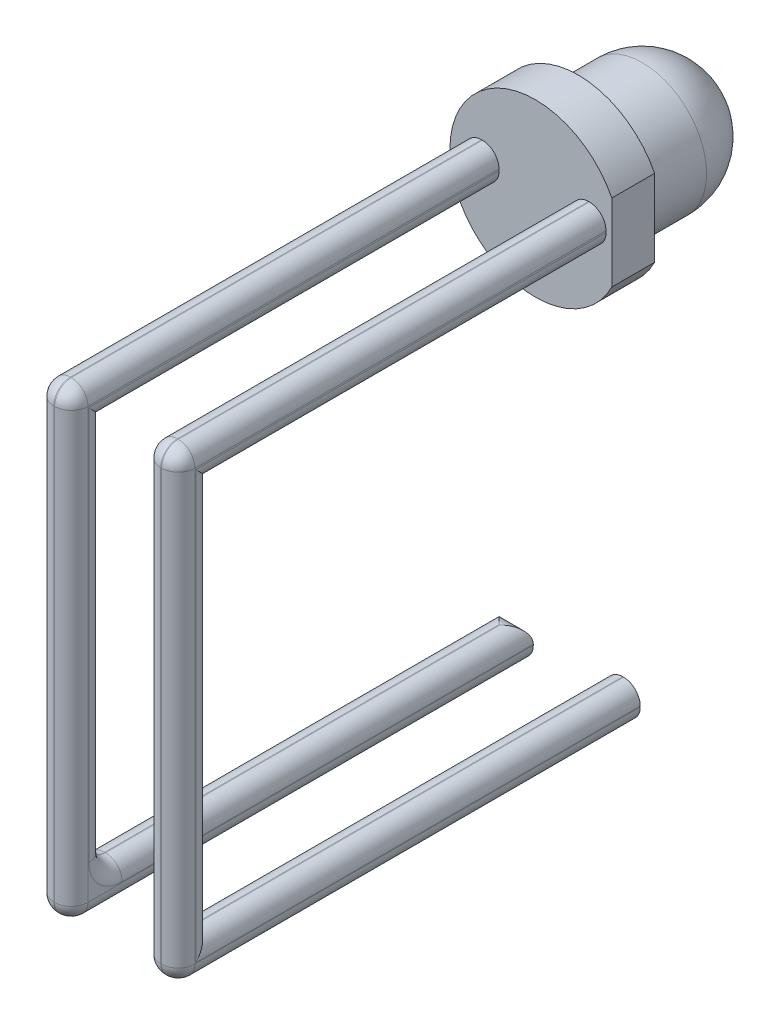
from build123d import *

# Parameters (mm, degrees)
ESQUISSE1_R             = 1.5
BASE_EXTRUSION_DEPTH    = 4
BOSS_EXTRU_1_DEPTH      = 1
CONG_1_R                = 1.5
ESQUISSE4_W             = 10
ESQUISSE4_H             = 0.82031978
BOSS_EXTRU_2_DEPTH      = 1.65
ESQUISSE5_W             = 1.7
ESQUISSE5_H             = 17.823982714
ENL_V_MAT_EXTRU_1_DEPTH = 10
ESQUISSE6_W             = 0.8
ESQUISSE6_H             = 0.8
EXTRUSION1_DEPTH        = 10
ESQUISSE7_W             = 0.8
ESQUISSE7_H             = 0.8
EXTRUSION2_DEPTH        = 10
CONG_2_R                = 0.39


with BuildPart() as part:
    # Esquisse1 → Base-Extrusion (new body)
    with BuildSketch(Plane.XY):
        Circle(ESQUISSE1_R)
    extrude(amount=BASE_EXTRUSION_DEPTH)

    # Esquisse2 → Boss.-Extru.1 (add)
    with BuildSketch(Plane.XY.offset(4)):
        with BuildLine():
            Line((1.785714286, 0.900680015), (1.785714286, -0.900680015))
            ThreePointArc((1.785714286, -0.900680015), (-2, 0), (1.785714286, 0.900680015))
        make_face()
    extrude(amount=-BOSS_EXTRU_1_DEPTH)

    # Cong_1
    cong_1_edges = [part.edges().sort_by_distance(p)[0] for p in [
        (-1.5, 0, 0),
    ]]
    fillet(cong_1_edges, radius=CONG_1_R)

    # Esquisse4 → Boss.-Extru.2 (add, symmetric)
    with BuildSketch(Plane(origin=(0, 0, 0), x_dir=(0, 0, -1), z_dir=(1, 0, 0))):
        with Locations((-9, 0.148855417)):
            Rectangle(ESQUISSE4_W, ESQUISSE4_H)
    extrude(amount=BOSS_EXTRU_2_DEPTH, both=True)

    # Esquisse5 → Enl_v. mat.-Extru.1 (cut)
    with BuildSketch(Plane.XY.offset(4)):
        with Locations((0, -8.28809112)):
            Rectangle(ESQUISSE5_W, ESQUISSE5_H)
    extrude(amount=ENL_V_MAT_EXTRU_1_DEPTH, mode=Mode.SUBTRACT)

    # Esquisse6 → Extrusion1 (add)
    with BuildSketch(Plane.XZ.offset(0.261304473)):
        with Locations((1.25, 13.6)):
            Rectangle(ESQUISSE6_W, ESQUISSE6_H)
        with Locations((-1.25, 13.6)):
            Rectangle(ESQUISSE6_W, ESQUISSE6_H)
    extrude(amount=EXTRUSION1_DEPTH)

    # Esquisse7 → Extrusion2 (add)
    with BuildSketch(Plane(origin=(0, 0, 13.2), x_dir=(-1, 0, 0), z_dir=(0, 0, -1))):
        with Locations((-1.25, -9.861304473)):
            Rectangle(ESQUISSE7_W, ESQUISSE7_H)
        with Locations((1.25, -9.861304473)):
            Rectangle(ESQUISSE7_W, ESQUISSE7_H)
    extrude(amount=EXTRUSION2_DEPTH)

    # Cong_2
    cong_2_edges = [part.edges().sort_by_distance(p)[0] for p in [
        (-1.65, 0.559015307, 9),
        (-1.65, -4.851144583, 14),
        (1.25, 0.559015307, 14),
        (1.65, 0.559015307, 9),
        (1.65, -4.851144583, 14),
        (-1.25, 0.559015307, 14),
        (0.85, -4.851144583, 14),
        (-0.85, -4.851144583, 14),
        (0.85, -0.261304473, 8.6),
        (-0.85, 0.559015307, 9),
        (0.85, 0.559015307, 9),
        (1.65, -0.261304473, 8.6),
        (1.65, -10.261304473, 8.6),
        (1.25, -10.261304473, 14),
        (0.85, -10.261304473, 8.6),
        (-0.85, -0.261304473, 8.6),
        (-1.65, -0.261304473, 8.6),
        (-0.85, -10.261304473, 8.6),
        (-1.25, -10.261304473, 14),
        (-1.65, -10.261304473, 8.6),
        (1.65, -4.861304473, 13.2),
        (0.85, -4.861304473, 13.2),
        (1.65, -9.461304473, 8.2),
        (0.85, -9.461304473, 8.2),
        (-0.85, -4.861304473, 13.2),
        (-1.65, -4.861304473, 13.2),
        (-0.85, -9.461304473, 8.2),
        (-1.25, -9.461304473, 13.2),
        (-1.65, -9.461304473, 8.2),
        (-1.25, -9.461304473, 3.2),
    ]]
    fillet(cong_2_edges, radius=CONG_2_R)


solid = part.part
